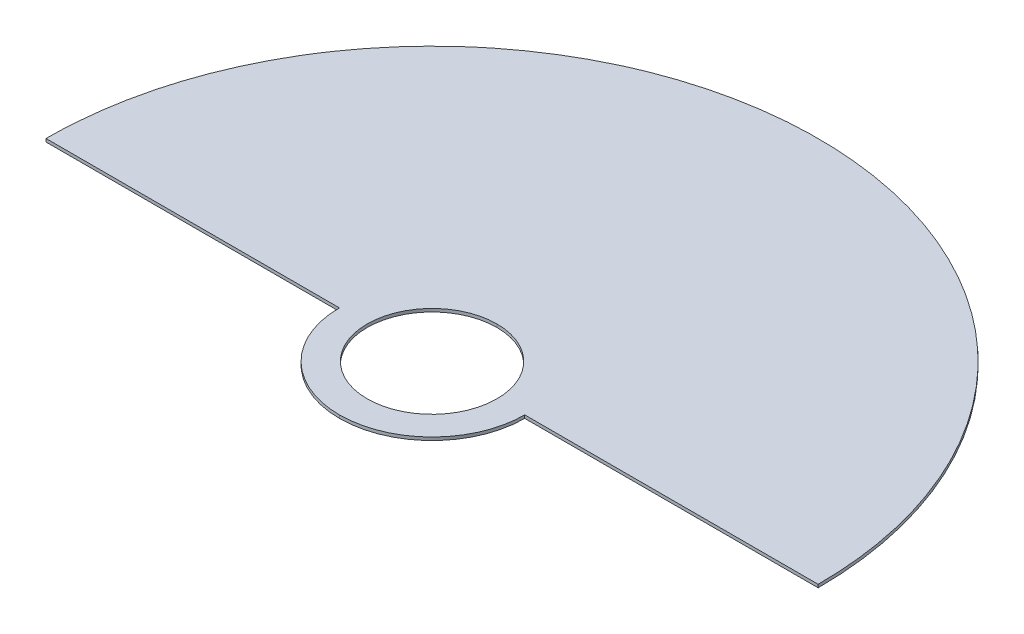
ISO-10303-21;
HEADER;
FILE_DESCRIPTION(('STEP AP214'),'2;1');
FILE_NAME('part.step','',(''),(''),'','','');
FILE_SCHEMA(('AUTOMOTIVE_DESIGN { 1 0 10303 214 1 1 1 1 }'));
ENDSEC;
DATA;
#1=APPLICATION_CONTEXT('core data for automotive mechanical design processes');
#2=APPLICATION_PROTOCOL_DEFINITION('international standard','automotive_design',2000,#1);
#3=PRODUCT_CONTEXT('',#1,'mechanical');
#4=PRODUCT('Part','Part','',(#3));
#5=PRODUCT_RELATED_PRODUCT_CATEGORY('part','',(#4));
#6=PRODUCT_DEFINITION_FORMATION('','',#4);
#7=PRODUCT_DEFINITION_CONTEXT('part definition',#1,'design');
#8=PRODUCT_DEFINITION('design','',#6,#7);
#9=PRODUCT_DEFINITION_SHAPE('','',#8);
#10=(LENGTH_UNIT() NAMED_UNIT(*) SI_UNIT(.MILLI.,.METRE.));
#11=(NAMED_UNIT(*) PLANE_ANGLE_UNIT() SI_UNIT($,.RADIAN.));
#12=(NAMED_UNIT(*) SI_UNIT($,.STERADIAN.) SOLID_ANGLE_UNIT());
#13=UNCERTAINTY_MEASURE_WITH_UNIT(LENGTH_MEASURE(1.E-05),#10,'distance_accuracy_value','');
#14=(GEOMETRIC_REPRESENTATION_CONTEXT(3) GLOBAL_UNCERTAINTY_ASSIGNED_CONTEXT((#13)) GLOBAL_UNIT_ASSIGNED_CONTEXT((#10,
#11,#12)) REPRESENTATION_CONTEXT('',''));
#15=CARTESIAN_POINT('',(0.,0.,0.));
#16=DIRECTION('',(0.,0.,1.));
#17=DIRECTION('',(1.,0.,0.));
#18=AXIS2_PLACEMENT_3D('',#15,#16,#17);
#19=CARTESIAN_POINT('',(0.,-1.,30.));
#20=CARTESIAN_POINT('',(0.,0.,30.));
#21=(BOUNDED_CURVE() B_SPLINE_CURVE(1,(#19,#20),.UNSPECIFIED.,.F.,
.F.) B_SPLINE_CURVE_WITH_KNOTS((2,2),(0.,1.),
.UNSPECIFIED.) CURVE() GEOMETRIC_REPRESENTATION_ITEM() RATIONAL_B_SPLINE_CURVE((1.,1.)) REPRESENTATION_ITEM(''));
#22=CARTESIAN_POINT('',(0.,-1.,0.));
#23=DIRECTION('',(0.,1.,0.));
#24=AXIS1_PLACEMENT('',#22,#23);
#25=SURFACE_OF_REVOLUTION('',#21,#24);
#26=CARTESIAN_POINT('',(-5.38759106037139E-09,-1.,30.));
#27=CARTESIAN_POINT('',(-5.38759106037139E-09,-0.958333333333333,30.));
#28=CARTESIAN_POINT('',(-5.38759106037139E-09,-0.916666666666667,30.));
#29=CARTESIAN_POINT('',(-5.38759106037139E-09,-0.833333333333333,30.));
#30=CARTESIAN_POINT('',(-5.38759106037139E-09,-0.791666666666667,30.));
#31=CARTESIAN_POINT('',(-5.38759106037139E-09,-0.708333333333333,30.));
#32=CARTESIAN_POINT('',(-5.38759106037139E-09,-0.666666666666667,30.));
#33=CARTESIAN_POINT('',(-5.38759106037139E-09,-0.583333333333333,30.));
#34=CARTESIAN_POINT('',(-5.38759106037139E-09,-0.541666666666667,30.));
#35=CARTESIAN_POINT('',(-5.38759106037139E-09,-0.458333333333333,30.));
#36=CARTESIAN_POINT('',(-5.38759106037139E-09,-0.416666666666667,30.));
#37=CARTESIAN_POINT('',(-5.38759106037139E-09,-0.333333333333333,30.));
#38=CARTESIAN_POINT('',(-5.38759106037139E-09,-0.291666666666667,30.));
#39=CARTESIAN_POINT('',(-5.38759106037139E-09,-0.208333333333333,30.));
#40=CARTESIAN_POINT('',(-5.38759106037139E-09,-0.166666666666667,30.));
#41=CARTESIAN_POINT('',(-5.38759106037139E-09,-0.0833333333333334,30.));
#42=CARTESIAN_POINT('',(-5.38759106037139E-09,-0.0416666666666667,30.));
#43=CARTESIAN_POINT('',(-5.38759106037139E-09,0.,30.));
#44=B_SPLINE_CURVE_WITH_KNOTS('',3,(#26,#27,#28,#29,#30,#31,#32,#33,#34,#35,#36,#37,#38,#39,#40,
#41,#42,#43),.UNSPECIFIED.,.F.,.F.,(4,2,2,2,2,2,2,2,4),(0.,0.125,0.25,0.375,0.5,0.625,0.75,
0.875,1.),.UNSPECIFIED.);
#45=CARTESIAN_POINT('',(-1.79586368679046E-09,-1.,29.9999999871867));
#46=VERTEX_POINT('',#45);
#47=CARTESIAN_POINT('',(-1.79586368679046E-09,0.,29.9999999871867));
#48=VERTEX_POINT('',#47);
#49=EDGE_CURVE('E94',#46,#48,#44,.T.);
#50=ORIENTED_EDGE('',*,*,#49,.T.);
#51=CARTESIAN_POINT('',(-29.999999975,0.,-4.8859988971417E-08));
#52=CARTESIAN_POINT('',(-30.0000415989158,0.,0.491466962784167));
#53=CARTESIAN_POINT('',(-29.9880406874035,0.,0.982940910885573));
#54=CARTESIAN_POINT('',(-29.9399621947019,0.,1.9635188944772));
#55=CARTESIAN_POINT('',(-29.9039428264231,0.,2.45262578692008));
#56=CARTESIAN_POINT('',(-29.8078363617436,0.,3.42847110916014));
#57=CARTESIAN_POINT('',(-29.747749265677,0.,3.91520953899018));
#58=CARTESIAN_POINT('',(-29.6035796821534,0.,4.88631932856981));
#59=CARTESIAN_POINT('',(-29.5194394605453,0.,5.37068210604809));
#60=CARTESIAN_POINT('',(-29.3276774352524,0.,6.33473712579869));
#61=CARTESIAN_POINT('',(-29.2200556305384,0.,6.8144293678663));
#62=CARTESIAN_POINT('',(-28.9816218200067,0.,7.7667884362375));
#63=CARTESIAN_POINT('',(-28.850866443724,0.,8.2394694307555));
#64=CARTESIAN_POINT('',(-28.5662227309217,0.,9.1778141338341));
#65=CARTESIAN_POINT('',(-28.4123343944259,0.,9.64347784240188));
#66=CARTESIAN_POINT('',(-28.0814824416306,0.,10.5678021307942));
#67=CARTESIAN_POINT('',(-27.9044638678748,0.,11.0264430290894));
#68=CARTESIAN_POINT('',(-27.5283082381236,0.,11.9345630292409));
#69=CARTESIAN_POINT('',(-27.3291711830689,0.,12.3840421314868));
#70=CARTESIAN_POINT('',(-26.9095228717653,0.,13.2715857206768));
#71=CARTESIAN_POINT('',(-26.6890643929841,0.,13.7096751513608));
#72=CARTESIAN_POINT('',(-26.2268280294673,0.,14.5744585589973));
#73=CARTESIAN_POINT('',(-25.9850501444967,0.,15.0011525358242));
#74=CARTESIAN_POINT('',(-25.4802287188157,0.,15.8431701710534));
#75=CARTESIAN_POINT('',(-25.2171351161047,0.,16.2584638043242));
#76=CARTESIAN_POINT('',(-24.6710418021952,0.,17.0757502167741));
#77=CARTESIAN_POINT('',(-24.3880420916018,0.,17.4777429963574));
#78=CARTESIAN_POINT('',(-23.8033060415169,0.,18.2663633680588));
#79=CARTESIAN_POINT('',(-23.5016165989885,0.,18.6530257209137));
#80=CARTESIAN_POINT('',(-22.8795510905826,0.,19.4110147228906));
#81=CARTESIAN_POINT('',(-22.5591750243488,0.,19.7823413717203));
#82=CARTESIAN_POINT('',(-21.8997840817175,0.,20.5096941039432));
#83=CARTESIAN_POINT('',(-21.5607259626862,0.,20.8656809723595));
#84=CARTESIAN_POINT('',(-20.8656809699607,0.,21.5607259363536));
#85=CARTESIAN_POINT('',(-20.5096940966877,0.,21.8997840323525));
#86=CARTESIAN_POINT('',(-19.7823413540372,0.,22.5591749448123));
#87=CARTESIAN_POINT('',(-19.4110146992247,0.,22.8795510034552));
#88=CARTESIAN_POINT('',(-18.6530256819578,0.,23.5016165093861));
#89=CARTESIAN_POINT('',(-18.2663633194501,0.,23.803305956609));
#90=CARTESIAN_POINT('',(-17.477742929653,0.,24.3880420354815));
#91=CARTESIAN_POINT('',(-17.0757501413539,0.,24.6710417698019));
#92=CARTESIAN_POINT('',(-16.2584637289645,0.,25.2171351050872));
#93=CARTESIAN_POINT('',(-15.843170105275,0.,25.4802287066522));
#94=CARTESIAN_POINT('',(-15.0011524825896,0.,25.9850501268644));
#95=CARTESIAN_POINT('',(-14.5744585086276,0.,26.22682800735));
#96=CARTESIAN_POINT('',(-13.7096751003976,0.,26.6890643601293));
#97=CARTESIAN_POINT('',(-13.2715856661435,0.,26.9095228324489));
#98=CARTESIAN_POINT('',(-12.3840420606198,0.,27.32917112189));
#99=CARTESIAN_POINT('',(-11.934562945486,0.,27.5283081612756));
#100=CARTESIAN_POINT('',(-11.0264429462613,0.,27.9044637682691));
#101=CARTESIAN_POINT('',(-10.5678020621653,0.,28.0814823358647));
#102=CARTESIAN_POINT('',(-9.64347780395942,0.,28.4123342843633));
#103=CARTESIAN_POINT('',(-9.17781411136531,0.,28.5662226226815));
#104=CARTESIAN_POINT('',(-8.23946944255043,0.,28.8508663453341));
#105=CARTESIAN_POINT('',(-7.76678846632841,0.,28.9816217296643));
#106=CARTESIAN_POINT('',(-6.81442943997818,0.,29.2200555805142));
#107=CARTESIAN_POINT('',(-6.33473722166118,0.,29.3276774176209));
#108=CARTESIAN_POINT('',(-5.37068221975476,0.,29.5194394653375));
#109=CARTESIAN_POINT('',(-4.88631943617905,0.,29.6035796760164));
#110=CARTESIAN_POINT('',(-3.91520963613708,0.,29.7477492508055));
#111=CARTESIAN_POINT('',(-3.42847120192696,0.,29.8078363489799));
#112=CARTESIAN_POINT('',(-2.45262586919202,0.,29.9039428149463));
#113=CARTESIAN_POINT('',(-1.96351897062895,0.,29.9399621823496));
#114=CARTESIAN_POINT('',(-0.98294097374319,0.,29.9880406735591));
#115=CARTESIAN_POINT('',(-0.491467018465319,0.,30.0000415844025));
#116=CARTESIAN_POINT('',(0.,0.,29.99999996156));
#117=B_SPLINE_CURVE_WITH_KNOTS('',3,(#51,#52,#53,#54,#55,#56,#57,#58,#59,#60,#61,#62,#63,#64,
#65,#66,#67,#68,#69,#70,#71,#72,#73,#74,#75,#76,#77,#78,#79,#80,#81,#82,#83,#84,#85,#86,#87,#88,
#89,#90,#91,#92,#93,#94,#95,#96,#97,#98,#99,#100,#101,#102,#103,#104,#105,#106,#107,#108,#109,
#110,#111,#112,#113,#114,#115,#116),.UNSPECIFIED.,.F.,.F.,(4,2,2,2,2,2,2,2,2,2,2,2,2,2,2,2,2,2,
2,2,2,2,2,2,2,2,2,2,2,2,2,2,4),(0.,1.47426294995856,2.9449656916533,4.41566841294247,
5.8899313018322,7.36419425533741,8.83489701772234,10.3055997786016,11.7798627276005,
13.2541256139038,14.7248283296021,16.1955310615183,17.669793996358,19.1440568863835,
20.6147596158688,22.0854623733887,23.559725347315,25.0339882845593,26.5046910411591,
27.9753938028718,29.4496567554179,30.9239196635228,32.3946223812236,33.865325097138,
35.3395879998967,36.8138509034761,38.2845536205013,39.7552563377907,41.2295192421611,
42.7037821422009,44.1744848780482,45.6451876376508,47.119450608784),.UNSPECIFIED.);
#118=CARTESIAN_POINT('',(-29.9999999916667,0.,-2.01335637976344E-08));
#119=VERTEX_POINT('',#118);
#120=EDGE_CURVE('E75',#119,#48,#117,.T.);
#121=ORIENTED_EDGE('',*,*,#120,.F.);
#122=CARTESIAN_POINT('',(-30.,-1.,0.));
#123=CARTESIAN_POINT('',(-30.,0.,0.));
#124=(BOUNDED_CURVE() B_SPLINE_CURVE(1,(#122,#123),.UNSPECIFIED.,.F.,
.F.) B_SPLINE_CURVE_WITH_KNOTS((2,2),(0.,1.),
.UNSPECIFIED.) CURVE() GEOMETRIC_REPRESENTATION_ITEM() RATIONAL_B_SPLINE_CURVE((1.,1.)) REPRESENTATION_ITEM(''));
#125=CARTESIAN_POINT('',(-29.9999999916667,-1.,-2.01335637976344E-08));
#126=VERTEX_POINT('',#125);
#127=EDGE_CURVE('E164',#126,#119,#124,.T.);
#128=ORIENTED_EDGE('',*,*,#127,.F.);
#129=CARTESIAN_POINT('',(0.,-1.,0.));
#130=DIRECTION('',(0.,1.,0.));
#131=DIRECTION('',(-1.,0.,-3.84689797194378E-10));
#132=AXIS2_PLACEMENT_3D('',#129,#130,#131);
#133=CIRCLE('',#132,30.);
#134=EDGE_CURVE('E97',#126,#46,#133,.T.);
#135=ORIENTED_EDGE('',*,*,#134,.T.);
#136=EDGE_LOOP('',(#50,#121,#128,#135));
#137=FACE_BOUND('',#136,.T.);
#138=ADVANCED_FACE('F15',(#137),#25,.T.);
#139=CARTESIAN_POINT('',(0.,-1.,30.));
#140=CARTESIAN_POINT('',(0.,0.,30.));
#141=(BOUNDED_CURVE() B_SPLINE_CURVE(1,(#139,#140),.UNSPECIFIED.,.F.,
.F.) B_SPLINE_CURVE_WITH_KNOTS((2,2),(0.,1.),
.UNSPECIFIED.) CURVE() GEOMETRIC_REPRESENTATION_ITEM() RATIONAL_B_SPLINE_CURVE((1.,1.)) REPRESENTATION_ITEM(''));
#142=CARTESIAN_POINT('',(0.,-1.,0.));
#143=DIRECTION('',(0.,1.,0.));
#144=AXIS1_PLACEMENT('',#142,#143);
#145=SURFACE_OF_REVOLUTION('',#141,#144);
#146=CARTESIAN_POINT('',(0.,-1.,0.));
#147=DIRECTION('',(0.,1.,0.));
#148=DIRECTION('',(0.,0.,1.));
#149=AXIS2_PLACEMENT_3D('',#146,#147,#148);
#150=CIRCLE('',#149,30.);
#151=CARTESIAN_POINT('',(29.9999999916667,-1.,-1.8337700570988E-08));
#152=VERTEX_POINT('',#151);
#153=EDGE_CURVE('E194',#46,#152,#150,.T.);
#154=ORIENTED_EDGE('',*,*,#153,.T.);
#155=CARTESIAN_POINT('',(30.,0.,0.));
#156=CARTESIAN_POINT('',(30.,-1.,0.));
#157=(BOUNDED_CURVE() B_SPLINE_CURVE(1,(#155,#156),.UNSPECIFIED.,.F.,
.F.) B_SPLINE_CURVE_WITH_KNOTS((2,2),(0.,1.),
.UNSPECIFIED.) CURVE() GEOMETRIC_REPRESENTATION_ITEM() RATIONAL_B_SPLINE_CURVE((1.,1.)) REPRESENTATION_ITEM(''));
#158=CARTESIAN_POINT('',(29.9999999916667,0.,-1.8337700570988E-08));
#159=VERTEX_POINT('',#158);
#160=EDGE_CURVE('E103',#159,#152,#157,.T.);
#161=ORIENTED_EDGE('',*,*,#160,.F.);
#162=CARTESIAN_POINT('',(0.,0.,29.99999996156));
#163=CARTESIAN_POINT('',(0.491467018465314,0.,30.0000415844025));
#164=CARTESIAN_POINT('',(0.98294097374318,0.,29.9880406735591));
#165=CARTESIAN_POINT('',(1.96351897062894,0.,29.9399621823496));
#166=CARTESIAN_POINT('',(2.452625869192,0.,29.9039428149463));
#167=CARTESIAN_POINT('',(3.42847120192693,0.,29.8078363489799));
#168=CARTESIAN_POINT('',(3.91520963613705,0.,29.7477492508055));
#169=CARTESIAN_POINT('',(4.88631943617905,0.,29.6035796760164));
#170=CARTESIAN_POINT('',(5.37068221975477,0.,29.5194394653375));
#171=CARTESIAN_POINT('',(6.33473722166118,0.,29.3276774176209));
#172=CARTESIAN_POINT('',(6.81442943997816,0.,29.2200555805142));
#173=CARTESIAN_POINT('',(7.76678846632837,0.,28.9816217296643));
#174=CARTESIAN_POINT('',(8.23946944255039,0.,28.8508663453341));
#175=CARTESIAN_POINT('',(9.17781411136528,0.,28.5662226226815));
#176=CARTESIAN_POINT('',(9.64347780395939,0.,28.4123342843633));
#177=CARTESIAN_POINT('',(10.5678020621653,0.,28.0814823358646));
#178=CARTESIAN_POINT('',(11.0264429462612,0.,27.9044637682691));
#179=CARTESIAN_POINT('',(11.934562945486,0.,27.5283081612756));
#180=CARTESIAN_POINT('',(12.3840420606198,0.,27.32917112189));
#181=CARTESIAN_POINT('',(13.2715856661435,0.,26.9095228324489));
#182=CARTESIAN_POINT('',(13.7096751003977,0.,26.6890643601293));
#183=CARTESIAN_POINT('',(14.5744585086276,0.,26.22682800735));
#184=CARTESIAN_POINT('',(15.0011524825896,0.,25.9850501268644));
#185=CARTESIAN_POINT('',(15.843170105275,0.,25.4802287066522));
#186=CARTESIAN_POINT('',(16.2584637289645,0.,25.2171351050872));
#187=CARTESIAN_POINT('',(17.0757501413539,0.,24.6710417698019));
#188=CARTESIAN_POINT('',(17.477742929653,0.,24.3880420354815));
#189=CARTESIAN_POINT('',(18.26636331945,0.,23.803305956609));
#190=CARTESIAN_POINT('',(18.6530256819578,0.,23.5016165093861));
#191=CARTESIAN_POINT('',(19.4110146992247,0.,22.8795510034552));
#192=CARTESIAN_POINT('',(19.7823413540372,0.,22.5591749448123));
#193=CARTESIAN_POINT('',(20.5096940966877,0.,21.8997840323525));
#194=CARTESIAN_POINT('',(20.8656809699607,0.,21.5607259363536));
#195=CARTESIAN_POINT('',(21.5607259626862,0.,20.8656809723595));
#196=CARTESIAN_POINT('',(21.8997840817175,0.,20.5096941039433));
#197=CARTESIAN_POINT('',(22.5591750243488,0.,19.7823413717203));
#198=CARTESIAN_POINT('',(22.8795510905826,0.,19.4110147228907));
#199=CARTESIAN_POINT('',(23.5016165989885,0.,18.6530257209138));
#200=CARTESIAN_POINT('',(23.8033060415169,0.,18.2663633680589));
#201=CARTESIAN_POINT('',(24.3880420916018,0.,17.4777429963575));
#202=CARTESIAN_POINT('',(24.6710418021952,0.,17.0757502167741));
#203=CARTESIAN_POINT('',(25.2171351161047,0.,16.2584638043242));
#204=CARTESIAN_POINT('',(25.4802287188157,0.,15.8431701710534));
#205=CARTESIAN_POINT('',(25.9850501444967,0.,15.0011525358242));
#206=CARTESIAN_POINT('',(26.2268280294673,0.,14.5744585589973));
#207=CARTESIAN_POINT('',(26.6890643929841,0.,13.7096751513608));
#208=CARTESIAN_POINT('',(26.9095228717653,0.,13.2715857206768));
#209=CARTESIAN_POINT('',(27.3291711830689,0.,12.3840421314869));
#210=CARTESIAN_POINT('',(27.5283082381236,0.,11.9345630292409));
#211=CARTESIAN_POINT('',(27.9044638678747,0.,11.0264430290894));
#212=CARTESIAN_POINT('',(28.0814824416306,0.,10.5678021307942));
#213=CARTESIAN_POINT('',(28.4123343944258,0.,9.64347784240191));
#214=CARTESIAN_POINT('',(28.5662227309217,0.,9.17781413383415));
#215=CARTESIAN_POINT('',(28.850866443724,0.,8.23946943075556));
#216=CARTESIAN_POINT('',(28.9816218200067,0.,7.76678843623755));
#217=CARTESIAN_POINT('',(29.2200556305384,0.,6.81442936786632));
#218=CARTESIAN_POINT('',(29.3276774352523,0.,6.3347371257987));
#219=CARTESIAN_POINT('',(29.5194394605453,0.,5.37068210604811));
#220=CARTESIAN_POINT('',(29.6035796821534,0.,4.88631932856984));
#221=CARTESIAN_POINT('',(29.747749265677,0.,3.91520953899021));
#222=CARTESIAN_POINT('',(29.8078363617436,0.,3.42847110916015));
#223=CARTESIAN_POINT('',(29.9039428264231,0.,2.45262578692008));
#224=CARTESIAN_POINT('',(29.9399621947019,0.,1.96351889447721));
#225=CARTESIAN_POINT('',(29.9880406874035,0.,0.982940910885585));
#226=CARTESIAN_POINT('',(30.0000415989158,0.,0.491466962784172));
#227=CARTESIAN_POINT('',(29.999999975,0.,-4.8859988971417E-08));
#228=B_SPLINE_CURVE_WITH_KNOTS('',3,(#162,#163,#164,#165,#166,#167,#168,#169,#170,#171,#172,
#173,#174,#175,#176,#177,#178,#179,#180,#181,#182,#183,#184,#185,#186,#187,#188,#189,#190,#191,
#192,#193,#194,#195,#196,#197,#198,#199,#200,#201,#202,#203,#204,#205,#206,#207,#208,#209,#210,
#211,#212,#213,#214,#215,#216,#217,#218,#219,#220,#221,#222,#223,#224,#225,#226,#227),
.UNSPECIFIED.,.F.,.F.,(4,2,2,2,2,2,2,2,2,2,2,2,2,2,2,2,2,2,2,2,2,2,2,2,2,2,2,2,2,2,2,2,4),(0.,
1.47426297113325,2.94496573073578,4.41566846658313,5.88993136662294,7.36419427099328,
8.83489698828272,10.3055997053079,11.7798626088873,13.254125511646,14.7248282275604,
16.1955309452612,17.6697938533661,19.1440568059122,20.6147595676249,22.0854623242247,
23.559725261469,25.0339882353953,26.5046909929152,27.9753937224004,29.4496566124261,
30.9239195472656,32.3946222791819,33.8653249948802,35.3395878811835,36.8138508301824,
38.2845535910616,39.7552563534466,41.2295193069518,42.7037821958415,44.1744849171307,
45.6451876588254,47.119450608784),.UNSPECIFIED.);
#229=EDGE_CURVE('E80',#48,#159,#228,.T.);
#230=ORIENTED_EDGE('',*,*,#229,.F.);
#231=ORIENTED_EDGE('',*,*,#49,.F.);
#232=EDGE_LOOP('',(#154,#161,#230,#231));
#233=FACE_BOUND('',#232,.T.);
#234=ADVANCED_FACE('F107',(#233),#145,.T.);
#235=CARTESIAN_POINT('',(30.,-1.,0.));
#236=CARTESIAN_POINT('',(30.,0.,0.));
#237=CARTESIAN_POINT('',(125.,-1.,0.));
#238=CARTESIAN_POINT('',(125.,0.,0.));
#239=(BOUNDED_SURFACE() B_SPLINE_SURFACE(1,1,((#235,#236),(#237,#238)),.UNSPECIFIED.,.F.,.F.,
.F.) B_SPLINE_SURFACE_WITH_KNOTS((2,2),(2,2),(0.,1.),(0.,1.),
.UNSPECIFIED.) GEOMETRIC_REPRESENTATION_ITEM() RATIONAL_B_SPLINE_SURFACE(((1.,1.),(1.,1.))) REPRESENTATION_ITEM('') SURFACE());
#240=CARTESIAN_POINT('',(30.,-1.,0.));
#241=CARTESIAN_POINT('',(125.,-1.,0.));
#242=(BOUNDED_CURVE() B_SPLINE_CURVE(1,(#240,#241),.UNSPECIFIED.,.F.,
.F.) B_SPLINE_CURVE_WITH_KNOTS((2,2),(0.,1.),
.UNSPECIFIED.) CURVE() GEOMETRIC_REPRESENTATION_ITEM() RATIONAL_B_SPLINE_CURVE((1.,1.)) REPRESENTATION_ITEM(''));
#243=CARTESIAN_POINT('',(124.999999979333,-1.,-2.48326440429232E-08));
#244=VERTEX_POINT('',#243);
#245=EDGE_CURVE('E318',#152,#244,#242,.T.);
#246=CARTESIAN_POINT('',(125.,-1.,0.));
#247=CARTESIAN_POINT('',(125.,0.,0.));
#248=(BOUNDED_CURVE() B_SPLINE_CURVE(1,(#246,#247),.UNSPECIFIED.,.F.,
.F.) B_SPLINE_CURVE_WITH_KNOTS((2,2),(0.,1.),
.UNSPECIFIED.) CURVE() GEOMETRIC_REPRESENTATION_ITEM() RATIONAL_B_SPLINE_CURVE((1.,1.)) REPRESENTATION_ITEM(''));
#249=CARTESIAN_POINT('',(124.999999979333,0.,-2.48326440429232E-08));
#250=VERTEX_POINT('',#249);
#251=EDGE_CURVE('E278',#244,#250,#248,.T.);
#252=CARTESIAN_POINT('',(-126.5,0.,-4.8859988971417E-08));
#253=CARTESIAN_POINT('',(126.5,0.,-4.8859988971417E-08));
#254=(BOUNDED_CURVE() B_SPLINE_CURVE(1,(#252,#253),.UNSPECIFIED.,.F.,
.F.) B_SPLINE_CURVE_WITH_KNOTS((2,2),(0.,1.),
.UNSPECIFIED.) CURVE() GEOMETRIC_REPRESENTATION_ITEM() RATIONAL_B_SPLINE_CURVE((1.,1.)) REPRESENTATION_ITEM(''));
#255=EDGE_CURVE('E111',#159,#250,#254,.T.);
#256=ORIENTED_EDGE('',*,*,#245,.T.);
#257=ORIENTED_EDGE('',*,*,#251,.T.);
#258=ORIENTED_EDGE('',*,*,#255,.F.);
#259=ORIENTED_EDGE('',*,*,#160,.T.);
#260=EDGE_LOOP('',(#256,#257,#258,#259));
#261=FACE_BOUND('',#260,.T.);
#262=ADVANCED_FACE('F129',(#261),#239,.T.);
#263=CARTESIAN_POINT('',(0.,-1.,125.));
#264=CARTESIAN_POINT('',(0.,0.,125.));
#265=(BOUNDED_CURVE() B_SPLINE_CURVE(1,(#263,#264),.UNSPECIFIED.,.F.,
.F.) B_SPLINE_CURVE_WITH_KNOTS((2,2),(0.,1.),
.UNSPECIFIED.) CURVE() GEOMETRIC_REPRESENTATION_ITEM() RATIONAL_B_SPLINE_CURVE((1.,1.)) REPRESENTATION_ITEM(''));
#266=CARTESIAN_POINT('',(0.,-1.,0.));
#267=DIRECTION('',(0.,1.,0.));
#268=AXIS1_PLACEMENT('',#266,#267);
#269=SURFACE_OF_REVOLUTION('',#265,#268);
#270=ORIENTED_EDGE('',*,*,#251,.F.);
#271=CARTESIAN_POINT('',(0.,-1.,0.));
#272=DIRECTION('',(0.,1.,0.));
#273=DIRECTION('',(1.,0.,-2.05103428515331E-10));
#274=AXIS2_PLACEMENT_3D('',#271,#272,#273);
#275=CIRCLE('',#274,125.);
#276=CARTESIAN_POINT('',(-124.999999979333,-1.,-3.23154084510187E-08));
#277=VERTEX_POINT('',#276);
#278=EDGE_CURVE('E204',#244,#277,#275,.T.);
#279=ORIENTED_EDGE('',*,*,#278,.T.);
#280=CARTESIAN_POINT('',(-125.,0.,0.));
#281=CARTESIAN_POINT('',(-125.,-1.,0.));
#282=(BOUNDED_CURVE() B_SPLINE_CURVE(1,(#280,#281),.UNSPECIFIED.,.F.,
.F.) B_SPLINE_CURVE_WITH_KNOTS((2,2),(0.,1.),
.UNSPECIFIED.) CURVE() GEOMETRIC_REPRESENTATION_ITEM() RATIONAL_B_SPLINE_CURVE((1.,1.)) REPRESENTATION_ITEM(''));
#283=CARTESIAN_POINT('',(-124.999999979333,0.,-3.23154084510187E-08));
#284=VERTEX_POINT('',#283);
#285=EDGE_CURVE('E184',#284,#277,#282,.T.);
#286=ORIENTED_EDGE('',*,*,#285,.F.);
#287=CARTESIAN_POINT('',(124.999999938,0.,-4.8859988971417E-08));
#288=CARTESIAN_POINT('',(125.000010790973,0.,-1.02296214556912));
#289=CARTESIAN_POINT('',(124.987473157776,0.,-2.04592513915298));
#290=CARTESIAN_POINT('',(124.937303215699,0.,-4.09061849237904));
#291=CARTESIAN_POINT('',(124.899686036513,0.,-5.11234922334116));
#292=CARTESIAN_POINT('',(124.799359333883,0.,-7.15457824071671));
#293=CARTESIAN_POINT('',(124.736649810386,0.,-8.17507652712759));
#294=CARTESIAN_POINT('',(124.586157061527,0.,-10.2148408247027));
#295=CARTESIAN_POINT('',(124.498358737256,0.,-11.2341057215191));
#296=CARTESIAN_POINT('',(124.297823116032,0.,-13.270179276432));
#297=CARTESIAN_POINT('',(124.185085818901,0.,-14.286987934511));
#298=CARTESIAN_POINT('',(123.934748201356,0.,-16.3169183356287));
#299=CARTESIAN_POINT('',(123.797162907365,0.,-17.3300419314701));
#300=CARTESIAN_POINT('',(123.497144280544,0.,-19.3526032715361));
#301=CARTESIAN_POINT('',(123.334710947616,0.,-20.3620410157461));
#302=CARTESIAN_POINT('',(122.985011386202,0.,-22.3772324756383));
#303=CARTESIAN_POINT('',(122.797730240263,0.,-23.3829836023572));
#304=CARTESIAN_POINT('',(122.398590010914,0.,-25.3895969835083));
#305=CARTESIAN_POINT('',(122.186730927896,0.,-26.3904592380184));
#306=CARTESIAN_POINT('',(121.738630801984,0.,-28.3860775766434));
#307=CARTESIAN_POINT('',(121.502404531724,0.,-29.3808369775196));
#308=CARTESIAN_POINT('',(121.005584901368,0.,-31.3642521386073));
#309=CARTESIAN_POINT('',(120.744991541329,0.,-32.3529078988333));
#310=CARTESIAN_POINT('',(120.19945260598,0.,-34.3241190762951));
#311=CARTESIAN_POINT('',(119.914492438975,0.,-35.306670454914));
#312=CARTESIAN_POINT('',(119.320591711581,0.,-37.2644988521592));
#313=CARTESIAN_POINT('',(119.011651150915,0.,-38.2397758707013));
#314=CARTESIAN_POINT('',(118.370103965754,0.,-40.1818632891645));
#315=CARTESIAN_POINT('',(118.037511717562,0.,-41.1486784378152));
#316=CARTESIAN_POINT('',(117.34867571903,0.,-43.0738460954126));
#317=CARTESIAN_POINT('',(116.99243196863,0.,-44.0321986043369));
#318=CARTESIAN_POINT('',(116.256307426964,0.,-45.9404457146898));
#319=CARTESIAN_POINT('',(115.876412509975,0.,-46.8903348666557));
#320=CARTESIAN_POINT('',(115.09347081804,0.,-48.7805233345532));
#321=CARTESIAN_POINT('',(114.690424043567,0.,-49.720822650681));
#322=CARTESIAN_POINT('',(113.861608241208,0.,-51.5906757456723));
#323=CARTESIAN_POINT('',(113.435853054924,0.,-52.5202356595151));
#324=CARTESIAN_POINT('',(112.561634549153,0.,-54.3686153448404));
#325=CARTESIAN_POINT('',(112.113171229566,0.,-55.2874351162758));
#326=CARTESIAN_POINT('',(111.193550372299,0.,-57.1143406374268));
#327=CARTESIAN_POINT('',(110.722379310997,0.,-58.0224195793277));
#328=CARTESIAN_POINT('',(109.757936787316,0.,-59.8267645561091));
#329=CARTESIAN_POINT('',(109.26466532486,0.,-60.7230305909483));
#330=CARTESIAN_POINT('',(108.256562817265,0.,-62.5026416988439));
#331=CARTESIAN_POINT('',(107.741744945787,0.,-63.3859942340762));
#332=CARTESIAN_POINT('',(106.690563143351,0.,-65.1397850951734));
#333=CARTESIAN_POINT('',(106.154199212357,0.,-66.0102234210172));
#334=CARTESIAN_POINT('',(105.059938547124,0.,-67.7381933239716));
#335=CARTESIAN_POINT('',(104.502029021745,0.,-68.5957168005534));
#336=CARTESIAN_POINT('',(103.365373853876,0.,-70.2968414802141));
#337=CARTESIAN_POINT('',(102.786628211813,0.,-71.1404426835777));
#338=CARTESIAN_POINT('',(101.608947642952,0.,-72.812673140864));
#339=CARTESIAN_POINT('',(101.01002509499,0.,-73.6413111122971));
#340=CARTESIAN_POINT('',(99.7920035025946,0.,-75.2836231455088));
#341=CARTESIAN_POINT('',(99.1729044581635,0.,-76.0972972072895));
#342=CARTESIAN_POINT('',(97.9145423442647,0.,-77.7096901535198));
#343=CARTESIAN_POINT('',(97.2752673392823,0.,-78.5083997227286));
#344=CARTESIAN_POINT('',(95.9773461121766,0.,-80.0899213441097));
#345=CARTESIAN_POINT('',(95.3186998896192,0.,-80.8727333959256));
#346=CARTESIAN_POINT('',(93.9827828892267,0.,-82.4214787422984));
#347=CARTESIAN_POINT('',(93.3055235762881,0.,-83.1874219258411));
#348=CARTESIAN_POINT('',(91.9323923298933,0.,-84.7024387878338));
#349=CARTESIAN_POINT('',(91.236520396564,0.,-85.4515124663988));
#350=CARTESIAN_POINT('',(89.8261754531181,0.,-86.9328002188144));
#351=CARTESIAN_POINT('',(89.1116914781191,0.,-87.6650038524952));
#352=CARTESIAN_POINT('',(87.6650038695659,0.,-89.1116914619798));
#353=CARTESIAN_POINT('',(86.932800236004,0.,-89.8261754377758));
#354=CARTESIAN_POINT('',(85.4515124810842,0.,-91.2365203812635));
#355=CARTESIAN_POINT('',(84.7024387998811,0.,-91.9323923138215));
#356=CARTESIAN_POINT('',(83.1874219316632,0.,-93.3055235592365));
#357=CARTESIAN_POINT('',(82.4214787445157,0.,-93.9827828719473));
#358=CARTESIAN_POINT('',(80.8727333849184,0.,-95.3186998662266));
#359=CARTESIAN_POINT('',(80.0899213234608,0.,-95.9773460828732));
#360=CARTESIAN_POINT('',(78.5083996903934,0.,-97.2752673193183));
#361=CARTESIAN_POINT('',(77.7096901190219,0.,-97.9145423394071));
#362=CARTESIAN_POINT('',(76.0972971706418,0.,-99.1729044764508));
#363=CARTESIAN_POINT('',(75.2836231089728,0.,-99.7920035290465));
#364=CARTESIAN_POINT('',(73.6413110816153,0.,-101.01002513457));
#365=CARTESIAN_POINT('',(72.8126731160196,0.,-101.608947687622));
#366=CARTESIAN_POINT('',(71.1404426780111,0.,-102.786628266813));
#367=CARTESIAN_POINT('',(70.2968414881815,0.,-103.365373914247));
#368=CARTESIAN_POINT('',(68.5957168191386,0.,-104.502029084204));
#369=CARTESIAN_POINT('',(67.7381933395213,0.,-105.059938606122));
#370=CARTESIAN_POINT('',(66.0102234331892,0.,-106.154199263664));
#371=CARTESIAN_POINT('',(65.1397851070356,0.,-106.690563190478));
#372=CARTESIAN_POINT('',(63.3859942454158,0.,-107.741744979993));
#373=CARTESIAN_POINT('',(62.5026417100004,0.,-108.256562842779));
#374=CARTESIAN_POINT('',(60.7230306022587,0.,-109.264665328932));
#375=CARTESIAN_POINT('',(59.8267645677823,0.,-109.757936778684));
#376=CARTESIAN_POINT('',(58.0224195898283,0.,-110.722379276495));
#377=CARTESIAN_POINT('',(57.1143406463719,0.,-111.193550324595));
#378=CARTESIAN_POINT('',(55.2874351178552,0.,-112.113171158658));
#379=CARTESIAN_POINT('',(54.3686153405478,0.,-112.561634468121));
#380=CARTESIAN_POINT('',(52.5202356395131,0.,-113.435852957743));
#381=CARTESIAN_POINT('',(51.5906757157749,0.,-113.86160813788));
#382=CARTESIAN_POINT('',(49.7208225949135,0.,-114.690423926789));
#383=CARTESIAN_POINT('',(48.7805232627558,0.,-115.093470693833));
#384=CARTESIAN_POINT('',(46.8903347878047,0.,-115.876412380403));
#385=CARTESIAN_POINT('',(45.9404456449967,0.,-116.256307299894));
#386=CARTESIAN_POINT('',(44.0321985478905,0.,-116.992431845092));
#387=CARTESIAN_POINT('',(43.0738460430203,0.,-117.348675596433));
#388=CARTESIAN_POINT('',(41.1486783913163,0.,-118.037511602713));
#389=CARTESIAN_POINT('',(40.1818632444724,0.,-118.370103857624));
#390=CARTESIAN_POINT('',(38.2397758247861,0.,-119.011651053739));
#391=CARTESIAN_POINT('',(37.264498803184,0.,-119.320591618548));
#392=CARTESIAN_POINT('',(35.306670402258,0.,-119.914492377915));
#393=CARTESIAN_POINT('',(34.3241190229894,0.,-120.199452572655));
#394=CARTESIAN_POINT('',(32.3529078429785,0.,-120.744991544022));
#395=CARTESIAN_POINT('',(31.3642520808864,0.,-121.005584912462));
#396=CARTESIAN_POINT('',(29.380836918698,0.,-121.502404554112));
#397=CARTESIAN_POINT('',(28.3860775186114,0.,-121.73863082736));
#398=CARTESIAN_POINT('',(26.3904591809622,0.,-122.186730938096));
#399=CARTESIAN_POINT('',(25.3895969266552,0.,-122.398590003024));
#400=CARTESIAN_POINT('',(23.382983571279,0.,-122.797730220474));
#401=CARTESIAN_POINT('',(22.3772324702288,0.,-122.985011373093));
#402=CARTESIAN_POINT('',(20.3620410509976,0.,-123.334710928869));
#403=CARTESIAN_POINT('',(19.3526033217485,0.,-123.497144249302));
#404=CARTESIAN_POINT('',(17.3300420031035,0.,-123.797162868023));
#405=CARTESIAN_POINT('',(16.3169184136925,0.,-123.93474816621));
#406=CARTESIAN_POINT('',(14.2869880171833,0.,-124.185085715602));
#407=CARTESIAN_POINT('',(13.2701793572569,0.,-124.297822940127));
#408=CARTESIAN_POINT('',(11.2341057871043,0.,-124.498358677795));
#409=CARTESIAN_POINT('',(10.2148408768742,0.,-124.586157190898));
#410=CARTESIAN_POINT('',(8.17507658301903,0.,-124.736649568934));
#411=CARTESIAN_POINT('',(7.15457831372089,0.,-124.799358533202));
#412=CARTESIAN_POINT('',(5.11234920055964,0.,-124.89968681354));
#413=CARTESIAN_POINT('',(4.09061835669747,0.,-124.93730612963));
#414=CARTESIAN_POINT('',(2.04592525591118,0.,-124.987470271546));
#415=CARTESIAN_POINT('',(1.02296262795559,0.,-124.99999996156));
#416=CARTESIAN_POINT('',(-1.02296262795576,0.,-124.99999996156));
#417=CARTESIAN_POINT('',(-2.04592525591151,0.,-124.987470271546));
#418=CARTESIAN_POINT('',(-4.0906183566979,0.,-124.93730612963));
#419=CARTESIAN_POINT('',(-5.11234920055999,0.,-124.89968681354));
#420=CARTESIAN_POINT('',(-7.15457831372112,0.,-124.799358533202));
#421=CARTESIAN_POINT('',(-8.17507658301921,0.,-124.736649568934));
#422=CARTESIAN_POINT('',(-10.2148408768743,0.,-124.586157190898));
#423=CARTESIAN_POINT('',(-11.2341057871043,0.,-124.498358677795));
#424=CARTESIAN_POINT('',(-13.2701793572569,0.,-124.297822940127));
#425=CARTESIAN_POINT('',(-14.2869880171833,0.,-124.185085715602));
#426=CARTESIAN_POINT('',(-16.3169184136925,0.,-123.93474816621));
#427=CARTESIAN_POINT('',(-17.3300420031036,0.,-123.797162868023));
#428=CARTESIAN_POINT('',(-19.3526033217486,0.,-123.497144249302));
#429=CARTESIAN_POINT('',(-20.3620410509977,0.,-123.334710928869));
#430=CARTESIAN_POINT('',(-22.3772324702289,0.,-122.985011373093));
#431=CARTESIAN_POINT('',(-23.382983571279,0.,-122.797730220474));
#432=CARTESIAN_POINT('',(-25.3895969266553,0.,-122.398590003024));
#433=CARTESIAN_POINT('',(-26.3904591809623,0.,-122.186730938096));
#434=CARTESIAN_POINT('',(-28.3860775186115,0.,-121.73863082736));
#435=CARTESIAN_POINT('',(-29.3808369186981,0.,-121.502404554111));
#436=CARTESIAN_POINT('',(-31.3642520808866,0.,-121.005584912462));
#437=CARTESIAN_POINT('',(-32.3529078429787,0.,-120.744991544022));
#438=CARTESIAN_POINT('',(-34.3241190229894,0.,-120.199452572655));
#439=CARTESIAN_POINT('',(-35.306670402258,0.,-119.914492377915));
#440=CARTESIAN_POINT('',(-37.2644988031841,0.,-119.320591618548));
#441=CARTESIAN_POINT('',(-38.2397758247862,0.,-119.011651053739));
#442=CARTESIAN_POINT('',(-40.1818632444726,0.,-118.370103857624));
#443=CARTESIAN_POINT('',(-41.1486783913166,0.,-118.037511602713));
#444=CARTESIAN_POINT('',(-43.0738460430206,0.,-117.348675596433));
#445=CARTESIAN_POINT('',(-44.0321985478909,0.,-116.992431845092));
#446=CARTESIAN_POINT('',(-45.940445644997,0.,-116.256307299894));
#447=CARTESIAN_POINT('',(-46.8903347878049,0.,-115.876412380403));
#448=CARTESIAN_POINT('',(-48.7805232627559,0.,-115.093470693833));
#449=CARTESIAN_POINT('',(-49.7208225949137,0.,-114.690423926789));
#450=CARTESIAN_POINT('',(-51.5906757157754,0.,-113.86160813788));
#451=CARTESIAN_POINT('',(-52.5202356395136,0.,-113.435852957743));
#452=CARTESIAN_POINT('',(-54.3686153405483,0.,-112.56163446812));
#453=CARTESIAN_POINT('',(-55.2874351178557,0.,-112.113171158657));
#454=CARTESIAN_POINT('',(-57.1143406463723,0.,-111.193550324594));
#455=CARTESIAN_POINT('',(-58.0224195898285,0.,-110.722379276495));
#456=CARTESIAN_POINT('',(-59.8267645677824,0.,-109.757936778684));
#457=CARTESIAN_POINT('',(-60.723030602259,0.,-109.264665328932));
#458=CARTESIAN_POINT('',(-62.5026417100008,0.,-108.256562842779));
#459=CARTESIAN_POINT('',(-63.3859942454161,0.,-107.741744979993));
#460=CARTESIAN_POINT('',(-65.1397851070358,0.,-106.690563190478));
#461=CARTESIAN_POINT('',(-66.0102234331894,0.,-106.154199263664));
#462=CARTESIAN_POINT('',(-67.7381933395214,0.,-105.059938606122));
#463=CARTESIAN_POINT('',(-68.5957168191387,0.,-104.502029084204));
#464=CARTESIAN_POINT('',(-70.2968414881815,0.,-103.365373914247));
#465=CARTESIAN_POINT('',(-71.1404426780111,0.,-102.786628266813));
#466=CARTESIAN_POINT('',(-72.8126731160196,0.,-101.608947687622));
#467=CARTESIAN_POINT('',(-73.6413110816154,0.,-101.01002513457));
#468=CARTESIAN_POINT('',(-75.2836231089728,0.,-99.7920035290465));
#469=CARTESIAN_POINT('',(-76.0972971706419,0.,-99.1729044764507));
#470=CARTESIAN_POINT('',(-77.709690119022,0.,-97.9145423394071));
#471=CARTESIAN_POINT('',(-78.5083996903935,0.,-97.2752673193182));
#472=CARTESIAN_POINT('',(-80.0899213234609,0.,-95.9773460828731));
#473=CARTESIAN_POINT('',(-80.8727333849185,0.,-95.3186998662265));
#474=CARTESIAN_POINT('',(-82.4214787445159,0.,-93.9827828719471));
#475=CARTESIAN_POINT('',(-83.1874219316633,0.,-93.3055235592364));
#476=CARTESIAN_POINT('',(-84.7024387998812,0.,-91.9323923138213));
#477=CARTESIAN_POINT('',(-85.4515124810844,0.,-91.2365203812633));
#478=CARTESIAN_POINT('',(-86.9328002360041,0.,-89.8261754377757));
#479=CARTESIAN_POINT('',(-87.665003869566,0.,-89.1116914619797));
#480=CARTESIAN_POINT('',(-89.1116914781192,0.,-87.6650038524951));
#481=CARTESIAN_POINT('',(-89.8261754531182,0.,-86.9328002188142));
#482=CARTESIAN_POINT('',(-91.2365203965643,0.,-85.4515124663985));
#483=CARTESIAN_POINT('',(-91.9323923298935,0.,-84.7024387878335));
#484=CARTESIAN_POINT('',(-93.3055235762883,0.,-83.1874219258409));
#485=CARTESIAN_POINT('',(-93.9827828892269,0.,-82.4214787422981));
#486=CARTESIAN_POINT('',(-95.3186998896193,0.,-80.8727333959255));
#487=CARTESIAN_POINT('',(-95.9773461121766,0.,-80.0899213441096));
#488=CARTESIAN_POINT('',(-97.2752673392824,0.,-78.5083997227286));
#489=CARTESIAN_POINT('',(-97.9145423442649,0.,-77.7096901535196));
#490=CARTESIAN_POINT('',(-99.1729044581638,0.,-76.0972972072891));
#491=CARTESIAN_POINT('',(-99.7920035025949,0.,-75.2836231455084));
#492=CARTESIAN_POINT('',(-101.01002509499,0.,-73.6413111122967));
#493=CARTESIAN_POINT('',(-101.608947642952,0.,-72.8126731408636));
#494=CARTESIAN_POINT('',(-102.786628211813,0.,-71.1404426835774));
#495=CARTESIAN_POINT('',(-103.365373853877,0.,-70.296841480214));
#496=CARTESIAN_POINT('',(-104.502029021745,0.,-68.5957168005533));
#497=CARTESIAN_POINT('',(-105.059938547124,0.,-67.7381933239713));
#498=CARTESIAN_POINT('',(-106.154199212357,0.,-66.0102234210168));
#499=CARTESIAN_POINT('',(-106.690563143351,0.,-65.1397850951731));
#500=CARTESIAN_POINT('',(-107.741744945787,0.,-63.385994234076));
#501=CARTESIAN_POINT('',(-108.256562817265,0.,-62.5026416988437));
#502=CARTESIAN_POINT('',(-109.26466532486,0.,-60.7230305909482));
#503=CARTESIAN_POINT('',(-109.757936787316,0.,-59.826764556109));
#504=CARTESIAN_POINT('',(-110.722379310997,0.,-58.0224195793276));
#505=CARTESIAN_POINT('',(-111.193550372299,0.,-57.1143406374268));
#506=CARTESIAN_POINT('',(-112.113171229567,0.,-55.2874351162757));
#507=CARTESIAN_POINT('',(-112.561634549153,0.,-54.3686153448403));
#508=CARTESIAN_POINT('',(-113.435853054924,0.,-52.520235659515));
#509=CARTESIAN_POINT('',(-113.861608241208,0.,-51.5906757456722));
#510=CARTESIAN_POINT('',(-114.690424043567,0.,-49.7208226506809));
#511=CARTESIAN_POINT('',(-115.09347081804,0.,-48.7805233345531));
#512=CARTESIAN_POINT('',(-115.876412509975,0.,-46.8903348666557));
#513=CARTESIAN_POINT('',(-116.256307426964,0.,-45.9404457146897));
#514=CARTESIAN_POINT('',(-116.99243196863,0.,-44.0321986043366));
#515=CARTESIAN_POINT('',(-117.348675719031,0.,-43.0738460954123));
#516=CARTESIAN_POINT('',(-118.037511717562,0.,-41.148678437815));
#517=CARTESIAN_POINT('',(-118.370103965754,0.,-40.1818632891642));
#518=CARTESIAN_POINT('',(-119.011651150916,0.,-38.2397758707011));
#519=CARTESIAN_POINT('',(-119.320591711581,0.,-37.2644988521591));
#520=CARTESIAN_POINT('',(-119.914492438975,0.,-35.3066704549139));
#521=CARTESIAN_POINT('',(-120.19945260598,0.,-34.3241190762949));
#522=CARTESIAN_POINT('',(-120.744991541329,0.,-32.3529078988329));
#523=CARTESIAN_POINT('',(-121.005584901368,0.,-31.3642521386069));
#524=CARTESIAN_POINT('',(-121.502404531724,0.,-29.3808369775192));
#525=CARTESIAN_POINT('',(-121.738630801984,0.,-28.386077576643));
#526=CARTESIAN_POINT('',(-122.186730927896,0.,-26.3904592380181));
#527=CARTESIAN_POINT('',(-122.398590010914,0.,-25.3895969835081));
#528=CARTESIAN_POINT('',(-122.797730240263,0.,-23.382983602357));
#529=CARTESIAN_POINT('',(-122.985011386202,0.,-22.377232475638));
#530=CARTESIAN_POINT('',(-123.334710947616,0.,-20.3620410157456));
#531=CARTESIAN_POINT('',(-123.497144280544,0.,-19.3526032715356));
#532=CARTESIAN_POINT('',(-123.797162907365,0.,-17.3300419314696));
#533=CARTESIAN_POINT('',(-123.934748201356,0.,-16.3169183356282));
#534=CARTESIAN_POINT('',(-124.185085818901,0.,-14.2869879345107));
#535=CARTESIAN_POINT('',(-124.297823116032,0.,-13.2701792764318));
#536=CARTESIAN_POINT('',(-124.498358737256,0.,-11.234105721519));
#537=CARTESIAN_POINT('',(-124.586157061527,0.,-10.2148408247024));
#538=CARTESIAN_POINT('',(-124.736649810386,0.,-8.17507652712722));
#539=CARTESIAN_POINT('',(-124.799359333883,0.,-7.15457824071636));
#540=CARTESIAN_POINT('',(-124.899686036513,0.,-5.1123492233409));
#541=CARTESIAN_POINT('',(-124.937303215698,0.,-4.09061849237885));
#542=CARTESIAN_POINT('',(-124.987473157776,0.,-2.0459251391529));
#543=CARTESIAN_POINT('',(-125.000010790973,0.,-1.02296214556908));
#544=CARTESIAN_POINT('',(-124.999999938,0.,-4.8859988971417E-08));
#545=B_SPLINE_CURVE_WITH_KNOTS('',3,(#287,#288,#289,#290,#291,#292,#293,#294,#295,#296,#297,
#298,#299,#300,#301,#302,#303,#304,#305,#306,#307,#308,#309,#310,#311,#312,#313,#314,#315,#316,
#317,#318,#319,#320,#321,#322,#323,#324,#325,#326,#327,#328,#329,#330,#331,#332,#333,#334,#335,
#336,#337,#338,#339,#340,#341,#342,#343,#344,#345,#346,#347,#348,#349,#350,#351,#352,#353,#354,
#355,#356,#357,#358,#359,#360,#361,#362,#363,#364,#365,#366,#367,#368,#369,#370,#371,#372,#373,
#374,#375,#376,#377,#378,#379,#380,#381,#382,#383,#384,#385,#386,#387,#388,#389,#390,#391,#392,
#393,#394,#395,#396,#397,#398,#399,#400,#401,#402,#403,#404,#405,#406,#407,#408,#409,#410,#411,
#412,#413,#414,#415,#416,#417,#418,#419,#420,#421,#422,#423,#424,#425,#426,#427,#428,#429,#430,
#431,#432,#433,#434,#435,#436,#437,#438,#439,#440,#441,#442,#443,#444,#445,#446,#447,#448,#449,
#450,#451,#452,#453,#454,#455,#456,#457,#458,#459,#460,#461,#462,#463,#464,#465,#466,#467,#468,
#469,#470,#471,#472,#473,#474,#475,#476,#477,#478,#479,#480,#481,#482,#483,#484,#485,#486,#487,
#488,#489,#490,#491,#492,#493,#494,#495,#496,#497,#498,#499,#500,#501,#502,#503,#504,#505,#506,
#507,#508,#509,#510,#511,#512,#513,#514,#515,#516,#517,#518,#519,#520,#521,#522,#523,#524,#525,
#526,#527,#528,#529,#530,#531,#532,#533,#534,#535,#536,#537,#538,#539,#540,#541,#542,#543,#544),
.UNSPECIFIED.,.F.,.F.,(4,2,2,2,2,2,2,2,2,2,2,2,2,2,2,2,2,2,2,2,2,2,2,2,2,2,2,2,2,2,2,2,2,2,2,2,
2,2,2,2,2,2,2,2,2,2,2,2,2,2,2,2,2,2,2,2,2,2,2,2,2,2,2,2,2,2,2,2,2,2,2,2,2,2,2,2,2,2,2,2,2,2,2,2,
2,2,2,2,2,2,2,2,2,2,2,2,2,2,2,2,2,2,2,2,2,2,2,2,2,2,2,2,2,2,2,2,2,2,2,2,2,2,2,2,2,2,2,2,4),(0.,
3.06881054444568,6.1357714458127,9.20273235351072,12.2715429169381,15.3403535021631,
18.4073144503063,21.4742754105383,24.5430860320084,27.6118966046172,30.6788575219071,
33.7458184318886,36.8146289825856,39.8834395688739,42.9504005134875,46.0173614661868,
49.0861720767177,52.1549826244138,55.2219435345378,58.288904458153,61.3577150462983,
64.4265256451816,67.4934865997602,70.5604475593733,73.6292581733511,76.6980687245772,
79.7650296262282,82.8319905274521,85.9008010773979,88.9696116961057,92.0365726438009,
95.1035335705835,98.1723441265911,101.241154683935,104.308115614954,107.375076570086,
110.443887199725,113.512697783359,116.579658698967,119.64661959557,122.715430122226,
125.784240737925,128.851201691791,131.918162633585,134.98697321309,138.055783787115,
141.122744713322,144.189705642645,147.258516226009,150.327326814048,153.394287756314,
156.461248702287,159.530059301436,162.598869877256,165.665830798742,168.732791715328,
171.801602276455,174.870412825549,177.93737373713,181.00433466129,184.073145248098,
187.141955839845,190.208916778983,193.275877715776,196.34468830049,199.413498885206,
202.480459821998,205.547420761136,208.616231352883,211.685041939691,214.752002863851,
217.818963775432,220.887774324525,223.956584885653,227.023545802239,230.090506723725,
233.159317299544,236.228127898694,239.295088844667,242.362049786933,245.430860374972,
248.499670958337,251.566631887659,254.633592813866,257.702403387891,260.771213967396,
263.83817490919,266.905135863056,269.973946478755,273.04275700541,276.109717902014,
279.176678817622,282.245489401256,285.314300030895,288.381260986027,291.448221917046,
294.51703247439,297.585843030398,300.65280395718,303.719764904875,306.788575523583,
309.857386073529,312.924346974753,315.991307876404,319.06011842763,322.128929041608,
325.195890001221,328.262850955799,331.331661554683,334.400472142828,337.467433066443,
340.534393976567,343.603204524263,346.672015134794,349.738976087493,352.805937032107,
355.874747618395,358.943558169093,362.010519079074,365.077479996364,368.146290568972,
371.215101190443,374.282062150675,377.349023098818,380.417833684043,383.48664424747,
386.553605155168,389.620566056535,392.689376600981),.UNSPECIFIED.);
#546=EDGE_CURVE('E288',#250,#284,#545,.T.);
#547=ORIENTED_EDGE('',*,*,#546,.F.);
#548=EDGE_LOOP('',(#270,#279,#286,#547));
#549=FACE_BOUND('',#548,.T.);
#550=ADVANCED_FACE('F224',(#549),#269,.T.);
#551=CARTESIAN_POINT('',(-125.,-1.,0.));
#552=CARTESIAN_POINT('',(-125.,0.,0.));
#553=CARTESIAN_POINT('',(-30.,-1.,0.));
#554=CARTESIAN_POINT('',(-30.,0.,0.));
#555=(BOUNDED_SURFACE() B_SPLINE_SURFACE(1,1,((#551,#552),(#553,#554)),.UNSPECIFIED.,.F.,.F.,
.F.) B_SPLINE_SURFACE_WITH_KNOTS((2,2),(2,2),(0.,1.),(0.,1.),
.UNSPECIFIED.) GEOMETRIC_REPRESENTATION_ITEM() RATIONAL_B_SPLINE_SURFACE(((1.,1.),(1.,1.))) REPRESENTATION_ITEM('') SURFACE());
#556=CARTESIAN_POINT('',(-125.,-1.,0.));
#557=CARTESIAN_POINT('',(-30.,-1.,0.));
#558=(BOUNDED_CURVE() B_SPLINE_CURVE(1,(#556,#557),.UNSPECIFIED.,.F.,
.F.) B_SPLINE_CURVE_WITH_KNOTS((2,2),(0.,1.),
.UNSPECIFIED.) CURVE() GEOMETRIC_REPRESENTATION_ITEM() RATIONAL_B_SPLINE_CURVE((1.,1.)) REPRESENTATION_ITEM(''));
#559=EDGE_CURVE('E190',#277,#126,#558,.T.);
#560=CARTESIAN_POINT('',(-126.5,0.,-4.8859988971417E-08));
#561=CARTESIAN_POINT('',(126.5,0.,-4.8859988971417E-08));
#562=(BOUNDED_CURVE() B_SPLINE_CURVE(1,(#560,#561),.UNSPECIFIED.,.F.,
.F.) B_SPLINE_CURVE_WITH_KNOTS((2,2),(0.,1.),
.UNSPECIFIED.) CURVE() GEOMETRIC_REPRESENTATION_ITEM() RATIONAL_B_SPLINE_CURVE((1.,1.)) REPRESENTATION_ITEM(''));
#563=EDGE_CURVE('E84',#284,#119,#562,.T.);
#564=ORIENTED_EDGE('',*,*,#559,.T.);
#565=ORIENTED_EDGE('',*,*,#127,.T.);
#566=ORIENTED_EDGE('',*,*,#563,.F.);
#567=ORIENTED_EDGE('',*,*,#285,.T.);
#568=EDGE_LOOP('',(#564,#565,#566,#567));
#569=FACE_BOUND('',#568,.T.);
#570=ADVANCED_FACE('F200',(#569),#555,.T.);
#571=CARTESIAN_POINT('',(0.,-1.,21.));
#572=CARTESIAN_POINT('',(0.,0.,21.));
#573=(BOUNDED_CURVE() B_SPLINE_CURVE(1,(#571,#572),.UNSPECIFIED.,.F.,
.F.) B_SPLINE_CURVE_WITH_KNOTS((2,2),(0.,1.),
.UNSPECIFIED.) CURVE() GEOMETRIC_REPRESENTATION_ITEM() RATIONAL_B_SPLINE_CURVE((1.,1.)) REPRESENTATION_ITEM(''));
#574=CARTESIAN_POINT('',(0.,-1.,0.));
#575=DIRECTION('',(0.,1.,0.));
#576=AXIS1_PLACEMENT('',#574,#575);
#577=SURFACE_OF_REVOLUTION('',#573,#576);
#578=CARTESIAN_POINT('',(0.,-1.,21.));
#579=CARTESIAN_POINT('',(0.,-0.958333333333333,21.));
#580=CARTESIAN_POINT('',(0.,-0.916666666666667,21.));
#581=CARTESIAN_POINT('',(0.,-0.833333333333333,21.));
#582=CARTESIAN_POINT('',(0.,-0.791666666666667,21.));
#583=CARTESIAN_POINT('',(0.,-0.708333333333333,21.));
#584=CARTESIAN_POINT('',(0.,-0.666666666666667,21.));
#585=CARTESIAN_POINT('',(0.,-0.583333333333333,21.));
#586=CARTESIAN_POINT('',(0.,-0.541666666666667,21.));
#587=CARTESIAN_POINT('',(0.,-0.458333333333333,21.));
#588=CARTESIAN_POINT('',(0.,-0.416666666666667,21.));
#589=CARTESIAN_POINT('',(0.,-0.333333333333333,21.));
#590=CARTESIAN_POINT('',(0.,-0.291666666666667,21.));
#591=CARTESIAN_POINT('',(0.,-0.208333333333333,21.));
#592=CARTESIAN_POINT('',(0.,-0.166666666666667,21.));
#593=CARTESIAN_POINT('',(0.,-0.0833333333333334,21.));
#594=CARTESIAN_POINT('',(0.,-0.0416666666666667,21.));
#595=CARTESIAN_POINT('',(0.,0.,21.));
#596=B_SPLINE_CURVE_WITH_KNOTS('',3,(#578,#579,#580,#581,#582,#583,#584,#585,#586,#587,#588,
#589,#590,#591,#592,#593,#594,#595),.UNSPECIFIED.,.F.,.F.,(4,2,2,2,2,2,2,2,4),(0.,0.125,0.25,
0.375,0.5,0.625,0.75,0.875,1.),.UNSPECIFIED.);
#597=CARTESIAN_POINT('',(-1.25710458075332E-09,-1.,20.9999999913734));
#598=VERTEX_POINT('',#597);
#599=CARTESIAN_POINT('',(-1.25710458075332E-09,0.,20.9999999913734));
#600=VERTEX_POINT('',#599);
#601=EDGE_CURVE('E36',#598,#600,#596,.T.);
#602=ORIENTED_EDGE('',*,*,#601,.T.);
#603=CARTESIAN_POINT('',(0.,0.,-21.00000007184));
#604=CARTESIAN_POINT('',(0.344026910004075,0.,-21.0000292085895));
#605=CARTESIAN_POINT('',(0.688058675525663,0.,-20.991628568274));
#606=CARTESIAN_POINT('',(1.37446326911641,0.,-20.9579736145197));
#607=CARTESIAN_POINT('',(1.71683809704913,0.,-20.9327600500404));
#608=CARTESIAN_POINT('',(2.39992983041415,0.,-20.8654855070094));
#609=CARTESIAN_POINT('',(2.74064673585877,0.,-20.8234245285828));
#610=CARTESIAN_POINT('',(3.42042359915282,0.,-20.7225057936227));
#611=CARTESIAN_POINT('',(3.7594775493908,0.,-20.6636076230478));
#612=CARTESIAN_POINT('',(4.43431605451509,0.,-20.5293741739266));
#613=CARTESIAN_POINT('',(4.77010060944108,0.,-20.4540388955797));
#614=CARTESIAN_POINT('',(5.43675192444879,0.,-20.2871352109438));
#615=CARTESIAN_POINT('',(5.76762860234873,0.,-20.1956064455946));
#616=CARTESIAN_POINT('',(6.42446985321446,0.,-19.9963558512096));
#617=CARTESIAN_POINT('',(6.75043442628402,0.,-19.8886340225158));
#618=CARTESIAN_POINT('',(7.39746137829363,0.,-19.6570376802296));
#619=CARTESIAN_POINT('',(7.71850998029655,0.,-19.5331246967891));
#620=CARTESIAN_POINT('',(8.35419398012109,0.,-19.2698157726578));
#621=CARTESIAN_POINT('',(8.66882937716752,0.,-19.1304198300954));
#622=CARTESIAN_POINT('',(9.29010992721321,0.,-18.8366660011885));
#623=CARTESIAN_POINT('',(9.59677254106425,0.,-18.6823450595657));
#624=CARTESIAN_POINT('',(10.2021209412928,0.,-18.3587795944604));
#625=CARTESIAN_POINT('',(10.5008067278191,0.,-18.1895350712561));
#626=CARTESIAN_POINT('',(11.0902190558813,0.,-17.8361600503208));
#627=CARTESIAN_POINT('',(11.3809245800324,0.,-17.651994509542));
#628=CARTESIAN_POINT('',(11.9530250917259,0.,-17.2697291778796));
#629=CARTESIAN_POINT('',(12.2344200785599,0.,-17.0716293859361));
#630=CARTESIAN_POINT('',(12.7864543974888,0.,-16.6623141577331));
#631=CARTESIAN_POINT('',(13.0571180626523,0.,-16.4511315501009));
#632=CARTESIAN_POINT('',(13.5877103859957,0.,-16.0156857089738));
#633=CARTESIAN_POINT('',(13.8476390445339,0.,-15.7914224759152));
#634=CARTESIAN_POINT('',(14.3567859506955,0.,-15.3298488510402));
#635=CARTESIAN_POINT('',(14.6059767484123,0.,-15.0925081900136));
#636=CARTESIAN_POINT('',(15.0925082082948,0.,-14.6059767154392));
#637=CARTESIAN_POINT('',(15.3298488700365,0.,-14.3567859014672));
#638=CARTESIAN_POINT('',(15.7914224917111,0.,-13.8476389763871));
#639=CARTESIAN_POINT('',(16.0156857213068,0.,-13.5877103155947));
#640=CARTESIAN_POINT('',(16.451131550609,0.,-13.0571180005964));
#641=CARTESIAN_POINT('',(16.6623141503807,0.,-12.7864543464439));
#642=CARTESIAN_POINT('',(17.071629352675,0.,-12.234420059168));
#643=CARTESIAN_POINT('',(17.2697291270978,0.,-11.9530250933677));
#644=CARTESIAN_POINT('',(17.6519944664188,0.,-11.3809245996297));
#645=CARTESIAN_POINT('',(17.8361600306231,0.,-11.0902190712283));
#646=CARTESIAN_POINT('',(18.1895350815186,0.,-10.5008067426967));
#647=CARTESIAN_POINT('',(18.3587796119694,0.,-10.2021209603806));
#648=CARTESIAN_POINT('',(18.6823450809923,0.,-9.59677258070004));
#649=CARTESIAN_POINT('',(18.836666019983,0.,-9.29010998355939));
#650=CARTESIAN_POINT('',(19.1304198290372,0.,-8.66882947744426));
#651=CARTESIAN_POINT('',(19.269815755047,0.,-8.35419410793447));
#652=CARTESIAN_POINT('',(19.5331246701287,0.,-7.71851010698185));
#653=CARTESIAN_POINT('',(19.6570376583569,0.,-7.39746147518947));
#654=CARTESIAN_POINT('',(19.8886340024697,0.,-6.75043447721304));
#655=CARTESIAN_POINT('',(19.9963558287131,0.,-6.42446988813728));
#656=CARTESIAN_POINT('',(20.1956064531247,0.,-5.76762861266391));
#657=CARTESIAN_POINT('',(20.2871352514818,0.,-5.43675192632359));
#658=CARTESIAN_POINT('',(20.4540388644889,0.,-4.77010061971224));
#659=CARTESIAN_POINT('',(20.5293740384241,0.,-4.43431608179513));
#660=CARTESIAN_POINT('',(20.663607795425,0.,-3.75947754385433));
#661=CARTESIAN_POINT('',(20.7225063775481,0.,-3.42042354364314));
#662=CARTESIAN_POINT('',(20.8234239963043,0.,-2.74064677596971));
#663=CARTESIAN_POINT('',(20.8654834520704,0.,-2.3999300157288));
#664=CARTESIAN_POINT('',(20.9327621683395,0.,-1.71683788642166));
#665=CARTESIAN_POINT('',(20.9579814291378,0.,-1.37446251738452));
#666=CARTESIAN_POINT('',(20.9916208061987,0.,-0.68805944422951));
#667=CARTESIAN_POINT('',(21.0000001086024,0.,-0.344029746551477));
#668=CARTESIAN_POINT('',(21.0000001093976,0.,0.344029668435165));
#669=CARTESIAN_POINT('',(20.9916208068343,0.,0.688059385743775));
#670=CARTESIAN_POINT('',(20.957981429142,0.,1.3744624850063));
#671=CARTESIAN_POINT('',(20.9327621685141,0.,1.71683786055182));
#672=CARTESIAN_POINT('',(20.8654834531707,0.,2.39992999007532));
#673=CARTESIAN_POINT('',(20.8234239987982,0.,2.74064674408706));
#674=CARTESIAN_POINT('',(20.7225063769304,0.,3.42042348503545));
#675=CARTESIAN_POINT('',(20.6636077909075,0.,3.75947746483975));
#676=CARTESIAN_POINT('',(20.5293740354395,0.,4.4343160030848));
#677=CARTESIAN_POINT('',(20.4540388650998,0.,4.77010056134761));
#678=CARTESIAN_POINT('',(20.287135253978,0.,5.43675189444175));
#679=CARTESIAN_POINT('',(20.1956064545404,0.,5.76762858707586));
#680=CARTESIAN_POINT('',(19.9963558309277,0.,6.42446986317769));
#681=CARTESIAN_POINT('',(19.8886340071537,0.,6.75043444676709));
#682=CARTESIAN_POINT('',(19.6570376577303,0.,7.39746141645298));
#683=CARTESIAN_POINT('',(19.5331246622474,0.,7.71851002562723));
#684=CARTESIAN_POINT('',(19.2698157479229,0.,8.35419403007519));
#685=CARTESIAN_POINT('',(19.1304198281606,0.,8.6688294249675));
#686=CARTESIAN_POINT('',(18.8366660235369,0.,9.29010997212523));
#687=CARTESIAN_POINT('',(18.6823450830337,0.,9.59677258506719));
#688=CARTESIAN_POINT('',(18.3587796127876,0.,10.2021209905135));
#689=CARTESIAN_POINT('',(18.1895350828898,0.,10.500806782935));
#690=CARTESIAN_POINT('',(17.8361600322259,0.,11.0902191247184));
#691=CARTESIAN_POINT('',(17.6519944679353,0.,11.3809246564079));
#692=CARTESIAN_POINT('',(17.2697291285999,0.,11.9530251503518));
#693=CARTESIAN_POINT('',(17.0716293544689,0.,12.2344201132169));
#694=CARTESIAN_POINT('',(16.6623141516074,0.,12.786454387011));
#695=CARTESIAN_POINT('',(16.4511315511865,0.,13.0571180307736));
#696=CARTESIAN_POINT('',(16.0156857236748,0.,13.5877103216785));
#697=CARTESIAN_POINT('',(15.7914224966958,0.,13.8476389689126));
#698=CARTESIAN_POINT('',(15.3298488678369,0.,14.3567858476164));
#699=CARTESIAN_POINT('',(15.0925081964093,0.,14.605976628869));
#700=CARTESIAN_POINT('',(14.6059767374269,0.,15.0925081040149));
#701=CARTESIAN_POINT('',(14.356785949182,0.,15.3298487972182));
#702=CARTESIAN_POINT('',(13.8476390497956,0.,15.7914224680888));
#703=CARTESIAN_POINT('',(13.5877103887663,0.,16.0156857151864));
#704=CARTESIAN_POINT('',(13.0571180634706,0.,16.451131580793));
#705=CARTESIAN_POINT('',(12.7864543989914,0.,16.6623141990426));
#706=CARTESIAN_POINT('',(12.234420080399,0.,17.0716294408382));
#707=CARTESIAN_POINT('',(11.9530250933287,0.,17.2697292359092));
#708=CARTESIAN_POINT('',(11.3809245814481,0.,17.6519945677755));
#709=CARTESIAN_POINT('',(11.0902190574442,0.,17.8361601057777));
#710=CARTESIAN_POINT('',(10.500806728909,0.,18.1895351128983));
#711=CARTESIAN_POINT('',(10.2021209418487,0.,18.3587796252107));
#712=CARTESIAN_POINT('',(9.59677254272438,0.,18.682345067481));
#713=CARTESIAN_POINT('',(9.29010993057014,0.,18.83666599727));
#714=CARTESIAN_POINT('',(8.66882937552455,0.,19.1304197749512));
#715=CARTESIAN_POINT('',(8.35419397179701,0.,19.2698156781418));
#716=CARTESIAN_POINT('',(7.71850997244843,0.,19.5331246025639));
#717=CARTESIAN_POINT('',(7.39746137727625,0.,19.6570376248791));
#718=CARTESIAN_POINT('',(6.75043443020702,0.,19.8886340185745));
#719=CARTESIAN_POINT('',(6.42446985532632,0.,19.9963558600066));
#720=CARTESIAN_POINT('',(5.76762860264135,0.,20.1956064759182));
#721=CARTESIAN_POINT('',(5.4367519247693,0.,20.2871352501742));
#722=CARTESIAN_POINT('',(4.77010061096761,0.,20.4540389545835));
#723=CARTESIAN_POINT('',(4.43431605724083,0.,20.5293742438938));
#724=CARTESIAN_POINT('',(3.75947755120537,0.,20.6636076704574));
#725=CARTESIAN_POINT('',(3.42042359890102,0.,20.7225058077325));
#726=CARTESIAN_POINT('',(2.74064673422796,0.,20.8234244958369));
#727=CARTESIAN_POINT('',(2.39992982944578,0.,20.8654854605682));
#728=CARTESIAN_POINT('',(1.71683809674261,0.,20.9327599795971));
#729=CARTESIAN_POINT('',(1.37446326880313,0.,20.9579735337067));
#730=CARTESIAN_POINT('',(0.688058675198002,0.,20.9916284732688));
#731=CARTESIAN_POINT('',(0.344026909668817,0.,21.0000291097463));
#732=CARTESIAN_POINT('',(0.,0.,20.99999997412));
#733=B_SPLINE_CURVE_WITH_KNOTS('',3,(#603,#604,#605,#606,#607,#608,#609,#610,#611,#612,#613,
#614,#615,#616,#617,#618,#619,#620,#621,#622,#623,#624,#625,#626,#627,#628,#629,#630,#631,#632,
#633,#634,#635,#636,#637,#638,#639,#640,#641,#642,#643,#644,#645,#646,#647,#648,#649,#650,#651,
#652,#653,#654,#655,#656,#657,#658,#659,#660,#661,#662,#663,#664,#665,#666,#667,#668,#669,#670,
#671,#672,#673,#674,#675,#676,#677,#678,#679,#680,#681,#682,#683,#684,#685,#686,#687,#688,#689,
#690,#691,#692,#693,#694,#695,#696,#697,#698,#699,#700,#701,#702,#703,#704,#705,#706,#707,#708,
#709,#710,#711,#712,#713,#714,#715,#716,#717,#718,#719,#720,#721,#722,#723,#724,#725,#726,#727,
#728,#729,#730,#731,#732),.UNSPECIFIED.,.F.,.F.,(4,2,2,2,2,2,2,2,2,2,2,2,2,2,2,2,2,2,2,2,2,2,2,
2,2,2,2,2,2,2,2,2,2,2,2,2,2,2,2,2,2,2,2,2,2,2,2,2,2,2,2,2,2,2,2,2,2,2,2,2,2,2,2,2,4),(0.,
1.03198407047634,2.06147600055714,3.0909679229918,4.12295197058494,5.15493600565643,
6.18442788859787,7.21391974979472,8.24590371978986,9.27788781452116,10.3073797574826,
11.3368716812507,12.3688557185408,13.4008398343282,14.4303317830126,15.4598236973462,
16.49180771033,17.5237917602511,18.5532836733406,19.5827755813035,20.614759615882,
21.6467437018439,22.6762356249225,23.7057275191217,24.7377115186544,25.7696955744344,
26.7991874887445,27.8286793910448,28.8606634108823,29.8926474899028,30.922139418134,
31.9516313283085,32.9836153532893,34.0155994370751,35.045091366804,36.0745832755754,
37.1065672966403,38.1385513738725,39.1680432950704,40.197535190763,41.2295191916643,
42.2615032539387,43.2909951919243,44.3204871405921,45.3524712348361,46.3844552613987,
47.413947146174,48.4434390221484,49.4754230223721,50.5074070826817,51.5368990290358,
52.5663909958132,53.5983751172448,54.6303591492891,55.6598510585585,56.6893429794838,
57.7213270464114,58.7533110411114,59.782802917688,60.8122948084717,61.8442788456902,
62.8762628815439,63.9057547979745,64.9352467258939,65.9672307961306),.UNSPECIFIED.);
#734=CARTESIAN_POINT('',(-5.74289599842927E-09,0.,-21.0000000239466));
#735=VERTEX_POINT('',#734);
#736=EDGE_CURVE('E350',#735,#600,#733,.T.);
#737=ORIENTED_EDGE('',*,*,#736,.F.);
#738=CARTESIAN_POINT('',(-8.61434399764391E-09,0.,-21.));
#739=CARTESIAN_POINT('',(-8.61434399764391E-09,-0.0416666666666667,-21.));
#740=CARTESIAN_POINT('',(-8.61434399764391E-09,-0.0833333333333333,-21.));
#741=CARTESIAN_POINT('',(-8.61434399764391E-09,-0.166666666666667,-21.));
#742=CARTESIAN_POINT('',(-8.61434399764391E-09,-0.208333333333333,-21.));
#743=CARTESIAN_POINT('',(-8.61434399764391E-09,-0.291666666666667,-21.));
#744=CARTESIAN_POINT('',(-8.61434399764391E-09,-0.333333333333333,-21.));
#745=CARTESIAN_POINT('',(-8.61434399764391E-09,-0.416666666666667,-21.));
#746=CARTESIAN_POINT('',(-8.61434399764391E-09,-0.458333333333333,-21.));
#747=CARTESIAN_POINT('',(-8.61434399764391E-09,-0.541666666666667,-21.));
#748=CARTESIAN_POINT('',(-8.61434399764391E-09,-0.583333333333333,-21.));
#749=CARTESIAN_POINT('',(-8.61434399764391E-09,-0.666666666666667,-21.));
#750=CARTESIAN_POINT('',(-8.61434399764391E-09,-0.708333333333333,-21.));
#751=CARTESIAN_POINT('',(-8.61434399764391E-09,-0.791666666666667,-21.));
#752=CARTESIAN_POINT('',(-8.61434399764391E-09,-0.833333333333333,-21.));
#753=CARTESIAN_POINT('',(-8.61434399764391E-09,-0.916666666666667,-21.));
#754=CARTESIAN_POINT('',(-8.61434399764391E-09,-0.958333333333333,-21.));
#755=CARTESIAN_POINT('',(-8.61434399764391E-09,-1.,-21.));
#756=B_SPLINE_CURVE_WITH_KNOTS('',3,(#738,#739,#740,#741,#742,#743,#744,#745,#746,#747,#748,
#749,#750,#751,#752,#753,#754,#755),.UNSPECIFIED.,.F.,.F.,(4,2,2,2,2,2,2,2,4),(0.,0.125,0.25,
0.375,0.5,0.625,0.75,0.875,1.),.UNSPECIFIED.);
#757=CARTESIAN_POINT('',(-5.74289599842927E-09,-1.,-21.0000000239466));
#758=VERTEX_POINT('',#757);
#759=EDGE_CURVE('E183',#735,#758,#756,.T.);
#760=ORIENTED_EDGE('',*,*,#759,.T.);
#761=CARTESIAN_POINT('',(0.,-1.,0.));
#762=DIRECTION('',(0.,-1.,0.));
#763=DIRECTION('',(-4.10206857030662E-10,0.,-1.));
#764=AXIS2_PLACEMENT_3D('',#761,#762,#763);
#765=CIRCLE('',#764,21.);
#766=EDGE_CURVE('E89',#758,#598,#765,.T.);
#767=ORIENTED_EDGE('',*,*,#766,.T.);
#768=EDGE_LOOP('',(#602,#737,#760,#767));
#769=FACE_BOUND('',#768,.T.);
#770=ADVANCED_FACE('F223',(#769),#577,.F.);
#771=CARTESIAN_POINT('',(-126.5,-1.,-125.93));
#772=CARTESIAN_POINT('',(126.5,-1.,-125.93));
#773=CARTESIAN_POINT('',(-126.5,-1.,30.93));
#774=CARTESIAN_POINT('',(126.5,-1.,30.93));
#775=(BOUNDED_SURFACE() B_SPLINE_SURFACE(1,1,((#771,#772),(#773,#774)),.UNSPECIFIED.,.F.,.F.,
.F.) B_SPLINE_SURFACE_WITH_KNOTS((2,2),(2,2),(0.,1.),(0.,1.),
.UNSPECIFIED.) GEOMETRIC_REPRESENTATION_ITEM() RATIONAL_B_SPLINE_SURFACE(((1.,1.),(1.,1.))) REPRESENTATION_ITEM('') SURFACE());
#776=CARTESIAN_POINT('',(0.,-1.,0.));
#777=DIRECTION('',(0.,-1.,0.));
#778=DIRECTION('',(-1.79586368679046E-10,0.,1.));
#779=AXIS2_PLACEMENT_3D('',#776,#777,#778);
#780=CIRCLE('',#779,21.);
#781=EDGE_CURVE('E28',#598,#758,#780,.T.);
#782=ORIENTED_EDGE('',*,*,#781,.F.);
#783=ORIENTED_EDGE('',*,*,#766,.F.);
#784=EDGE_LOOP('',(#782,#783));
#785=FACE_BOUND('',#784,.T.);
#786=ORIENTED_EDGE('',*,*,#559,.F.);
#787=ORIENTED_EDGE('',*,*,#278,.F.);
#788=ORIENTED_EDGE('',*,*,#245,.F.);
#789=ORIENTED_EDGE('',*,*,#153,.F.);
#790=ORIENTED_EDGE('',*,*,#134,.F.);
#791=EDGE_LOOP('',(#786,#787,#788,#789,#790));
#792=FACE_BOUND('',#791,.T.);
#793=ADVANCED_FACE('F188',(#785,#792),#775,.F.);
#794=CARTESIAN_POINT('',(-126.5,0.,-125.93));
#795=CARTESIAN_POINT('',(126.5,0.,-125.93));
#796=CARTESIAN_POINT('',(-126.5,0.,30.93));
#797=CARTESIAN_POINT('',(126.5,0.,30.93));
#798=(BOUNDED_SURFACE() B_SPLINE_SURFACE(1,1,((#794,#795),(#796,#797)),.UNSPECIFIED.,.F.,.F.,
.F.) B_SPLINE_SURFACE_WITH_KNOTS((2,2),(2,2),(0.,1.),(0.,1.),
.UNSPECIFIED.) GEOMETRIC_REPRESENTATION_ITEM() RATIONAL_B_SPLINE_SURFACE(((1.,1.),(1.,1.))) REPRESENTATION_ITEM('') SURFACE());
#799=CARTESIAN_POINT('',(0.,0.,0.));
#800=DIRECTION('',(0.,1.,0.));
#801=DIRECTION('',(-4.10206857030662E-10,0.,-1.));
#802=AXIS2_PLACEMENT_3D('',#799,#800,#801);
#803=CIRCLE('',#802,21.);
#804=EDGE_CURVE('E9',#735,#600,#803,.T.);
#805=ORIENTED_EDGE('',*,*,#736,.T.);
#806=ORIENTED_EDGE('',*,*,#804,.F.);
#807=EDGE_LOOP('',(#805,#806));
#808=FACE_BOUND('',#807,.T.);
#809=ORIENTED_EDGE('',*,*,#546,.T.);
#810=ORIENTED_EDGE('',*,*,#563,.T.);
#811=ORIENTED_EDGE('',*,*,#120,.T.);
#812=ORIENTED_EDGE('',*,*,#229,.T.);
#813=ORIENTED_EDGE('',*,*,#255,.T.);
#814=EDGE_LOOP('',(#809,#810,#811,#812,#813));
#815=FACE_BOUND('',#814,.T.);
#816=ADVANCED_FACE('F78',(#808,#815),#798,.T.);
#817=CARTESIAN_POINT('',(0.,-1.,21.));
#818=CARTESIAN_POINT('',(0.,0.,21.));
#819=(BOUNDED_CURVE() B_SPLINE_CURVE(1,(#817,#818),.UNSPECIFIED.,.F.,
.F.) B_SPLINE_CURVE_WITH_KNOTS((2,2),(0.,1.),
.UNSPECIFIED.) CURVE() GEOMETRIC_REPRESENTATION_ITEM() RATIONAL_B_SPLINE_CURVE((1.,1.)) REPRESENTATION_ITEM(''));
#820=CARTESIAN_POINT('',(0.,-1.,0.));
#821=DIRECTION('',(0.,1.,0.));
#822=AXIS1_PLACEMENT('',#820,#821);
#823=SURFACE_OF_REVOLUTION('',#819,#822);
#824=ORIENTED_EDGE('',*,*,#804,.T.);
#825=ORIENTED_EDGE('',*,*,#601,.F.);
#826=ORIENTED_EDGE('',*,*,#781,.T.);
#827=ORIENTED_EDGE('',*,*,#759,.F.);
#828=EDGE_LOOP('',(#824,#825,#826,#827));
#829=FACE_BOUND('',#828,.T.);
#830=ADVANCED_FACE('F356',(#829),#823,.F.);
#831=CLOSED_SHELL('',(#138,#234,#262,#550,#570,#770,#793,#816,#830));
#832=MANIFOLD_SOLID_BREP('B1',#831);
#833=ADVANCED_BREP_SHAPE_REPRESENTATION('',(#18,#832),#14);
#834=SHAPE_DEFINITION_REPRESENTATION(#9,#833);
ENDSEC;
END-ISO-10303-21;
